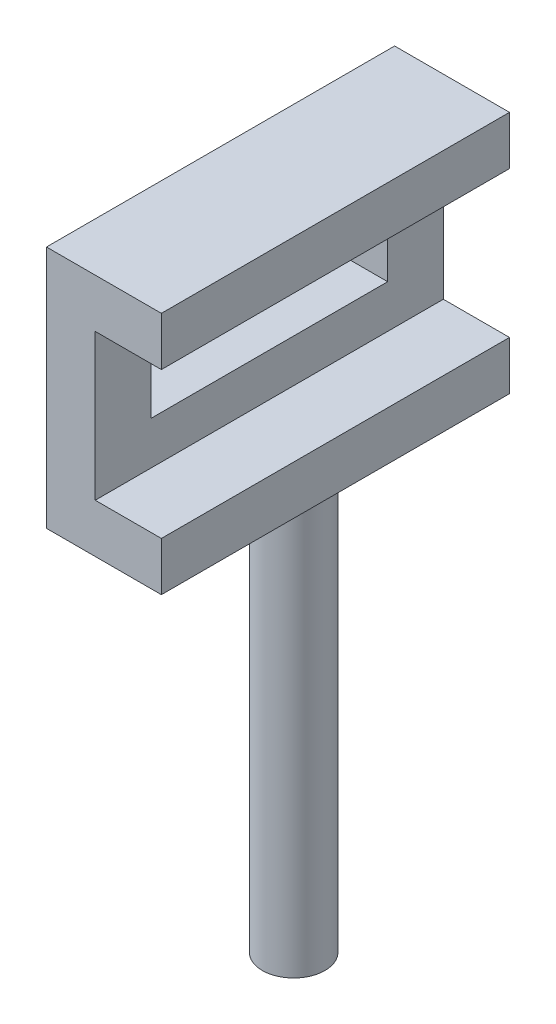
from build123d import *

# Parameters (mm, degrees)
BOSS_EXTRU_1_DEPTH      = 50
ESQUISSE2_R             = 4.5
BOSS_EXTRU_2_DEPTH      = 60
ESQUISSE3_W             = 34
ESQUISSE3_H             = 10
ENL_V_MAT_EXTRU_1_DEPTH = 60


with BuildPart() as part:
    # Esquisse1 → Boss.-Extru.1 (new body)
    with BuildSketch(Plane.XY):
        Polygon((-31.396714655, 15.767419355), (-40.896714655, 15.767419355), (-40.896714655, -5.232580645), (-31.396714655, -5.232580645), (-31.396714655, -12.232580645), (-47.896714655, -12.232580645), (-47.896714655, 22.767419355), (-31.396714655, 22.767419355), align=None)
    extrude(amount=BOSS_EXTRU_1_DEPTH)

    # Esquisse2 → Boss.-Extru.2 (add)
    with BuildSketch(Plane.XZ.offset(12.232580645)):
        with Locations(Location((-37.396714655, 25, 0), (0, 0, 180))):
            Circle(ESQUISSE2_R)
    extrude(amount=BOSS_EXTRU_2_DEPTH)

    # Esquisse3 → Enl_v. mat.-Extru.1 (cut)
    with BuildSketch(Plane.ZY.offset(47.896714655)):
        with Locations((25, 5.948713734)):
            Rectangle(ESQUISSE3_W, ESQUISSE3_H)
    extrude(amount=-ENL_V_MAT_EXTRU_1_DEPTH, mode=Mode.SUBTRACT)


solid = part.part
